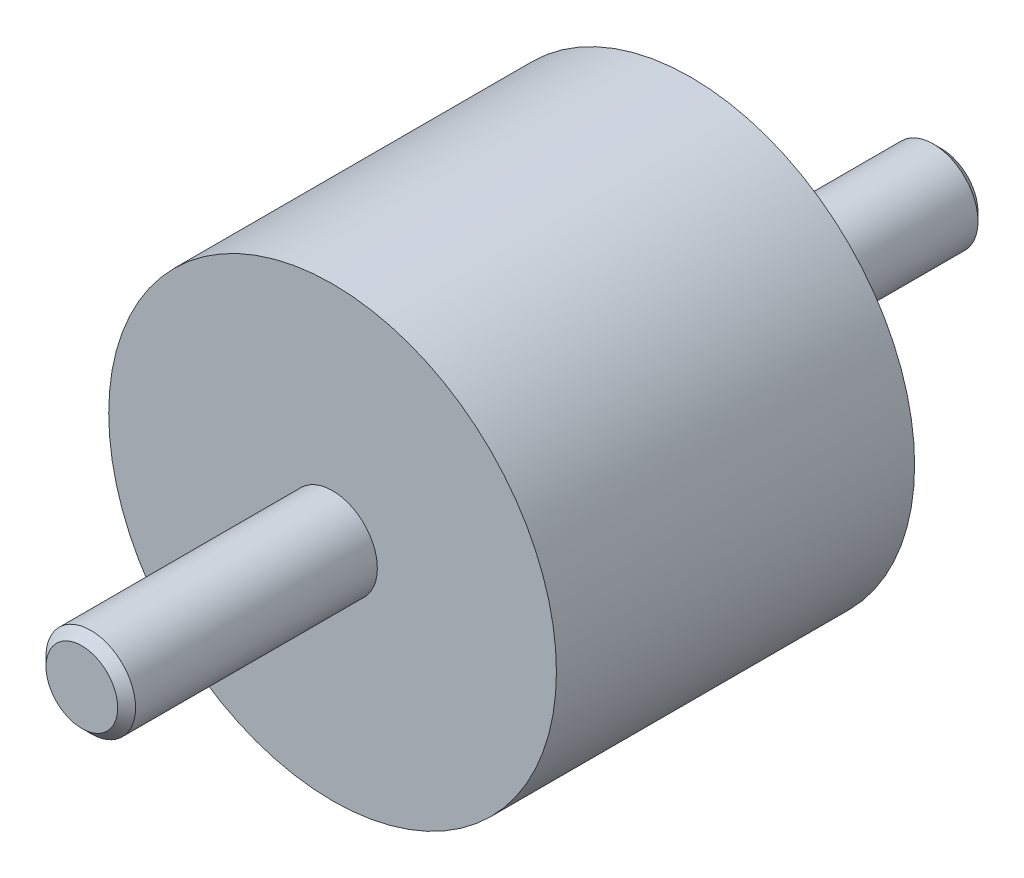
ISO-10303-21;
HEADER;
FILE_DESCRIPTION(('STEP AP214'),'2;1');
FILE_NAME('part.step','',(''),(''),'','','');
FILE_SCHEMA(('AUTOMOTIVE_DESIGN { 1 0 10303 214 1 1 1 1 }'));
ENDSEC;
DATA;
#1=APPLICATION_CONTEXT('core data for automotive mechanical design processes');
#2=APPLICATION_PROTOCOL_DEFINITION('international standard','automotive_design',2000,#1);
#3=PRODUCT_CONTEXT('',#1,'mechanical');
#4=PRODUCT('Part','Part','',(#3));
#5=PRODUCT_RELATED_PRODUCT_CATEGORY('part','',(#4));
#6=PRODUCT_DEFINITION_FORMATION('','',#4);
#7=PRODUCT_DEFINITION_CONTEXT('part definition',#1,'design');
#8=PRODUCT_DEFINITION('design','',#6,#7);
#9=PRODUCT_DEFINITION_SHAPE('','',#8);
#10=(LENGTH_UNIT() NAMED_UNIT(*) SI_UNIT(.MILLI.,.METRE.));
#11=(NAMED_UNIT(*) PLANE_ANGLE_UNIT() SI_UNIT($,.RADIAN.));
#12=(NAMED_UNIT(*) SI_UNIT($,.STERADIAN.) SOLID_ANGLE_UNIT());
#13=UNCERTAINTY_MEASURE_WITH_UNIT(LENGTH_MEASURE(1.E-05),#10,'distance_accuracy_value','');
#14=(GEOMETRIC_REPRESENTATION_CONTEXT(3) GLOBAL_UNCERTAINTY_ASSIGNED_CONTEXT((#13)) GLOBAL_UNIT_ASSIGNED_CONTEXT((#10,
#11,#12)) REPRESENTATION_CONTEXT('',''));
#15=CARTESIAN_POINT('',(0.,0.,0.));
#16=DIRECTION('',(0.,0.,1.));
#17=DIRECTION('',(1.,0.,0.));
#18=AXIS2_PLACEMENT_3D('',#15,#16,#17);
#19=CARTESIAN_POINT('',(0.,0.,0.66666666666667));
#20=DIRECTION('',(0.,0.,1.));
#21=DIRECTION('',(0.,-1.,0.));
#22=AXIS2_PLACEMENT_3D('',#19,#20,#21);
#23=CYLINDRICAL_SURFACE('',#22,25.);
#24=CARTESIAN_POINT('',(0.,0.,0.));
#25=DIRECTION('',(0.,0.,1.));
#26=DIRECTION('',(0.,-1.,0.));
#27=AXIS2_PLACEMENT_3D('',#24,#25,#26);
#28=CIRCLE('',#27,25.);
#29=CARTESIAN_POINT('',(0.,-25.,0.));
#30=VERTEX_POINT('',#29);
#31=EDGE_CURVE('E22',#30,#30,#28,.T.);
#32=ORIENTED_EDGE('',*,*,#31,.T.);
#33=EDGE_LOOP('',(#32));
#34=FACE_BOUND('',#33,.T.);
#35=CARTESIAN_POINT('',(0.,0.,40.));
#36=DIRECTION('',(0.,0.,-1.));
#37=DIRECTION('',(-1.,0.,0.));
#38=AXIS2_PLACEMENT_3D('',#35,#36,#37);
#39=CIRCLE('',#38,25.);
#40=CARTESIAN_POINT('',(-25.,0.,40.));
#41=VERTEX_POINT('',#40);
#42=EDGE_CURVE('E34',#41,#41,#39,.T.);
#43=ORIENTED_EDGE('',*,*,#42,.T.);
#44=EDGE_LOOP('',(#43));
#45=FACE_BOUND('',#44,.T.);
#46=ADVANCED_FACE('F12',(#34,#45),#23,.T.);
#47=CARTESIAN_POINT('',(25.,0.,0.));
#48=DIRECTION('',(0.,0.,-1.));
#49=DIRECTION('',(0.,1.,0.));
#50=AXIS2_PLACEMENT_3D('',#47,#48,#49);
#51=PLANE('',#50);
#52=CARTESIAN_POINT('',(0.,0.,0.));
#53=DIRECTION('',(0.,0.,-1.));
#54=DIRECTION('',(0.,1.,0.));
#55=AXIS2_PLACEMENT_3D('',#52,#53,#54);
#56=CIRCLE('',#55,5.);
#57=CARTESIAN_POINT('',(0.,5.,0.));
#58=VERTEX_POINT('',#57);
#59=EDGE_CURVE('E18',#58,#58,#56,.T.);
#60=ORIENTED_EDGE('',*,*,#59,.F.);
#61=EDGE_LOOP('',(#60));
#62=FACE_BOUND('',#61,.T.);
#63=ORIENTED_EDGE('',*,*,#31,.F.);
#64=EDGE_LOOP('',(#63));
#65=FACE_BOUND('',#64,.T.);
#66=ADVANCED_FACE('F57',(#62,#65),#51,.T.);
#67=CARTESIAN_POINT('',(0.,0.,-28.));
#68=DIRECTION('',(0.,0.,1.));
#69=DIRECTION('',(0.,-1.,0.));
#70=AXIS2_PLACEMENT_3D('',#67,#68,#69);
#71=CYLINDRICAL_SURFACE('',#70,5.);
#72=CARTESIAN_POINT('',(0.,0.,-27.08));
#73=DIRECTION('',(0.,0.,1.));
#74=DIRECTION('',(0.,-1.,0.));
#75=AXIS2_PLACEMENT_3D('',#72,#73,#74);
#76=CIRCLE('',#75,5.);
#77=CARTESIAN_POINT('',(0.,-5.,-27.08));
#78=VERTEX_POINT('',#77);
#79=EDGE_CURVE('E26',#78,#78,#76,.T.);
#80=ORIENTED_EDGE('',*,*,#79,.T.);
#81=EDGE_LOOP('',(#80));
#82=FACE_BOUND('',#81,.T.);
#83=ORIENTED_EDGE('',*,*,#59,.T.);
#84=EDGE_LOOP('',(#83));
#85=FACE_BOUND('',#84,.T.);
#86=ADVANCED_FACE('F62',(#82,#85),#71,.T.);
#87=CARTESIAN_POINT('',(0.,0.,-27.08));
#88=DIRECTION('',(0.,0.,1.));
#89=DIRECTION('',(0.,-1.,0.));
#90=AXIS2_PLACEMENT_3D('',#87,#88,#89);
#91=CONICAL_SURFACE('',#90,5.,0.785398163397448);
#92=CARTESIAN_POINT('',(0.,0.,-28.));
#93=DIRECTION('',(0.,0.,1.));
#94=DIRECTION('',(0.,-1.,0.));
#95=AXIS2_PLACEMENT_3D('',#92,#93,#94);
#96=CIRCLE('',#95,4.08);
#97=CARTESIAN_POINT('',(0.,-4.08,-28.));
#98=VERTEX_POINT('',#97);
#99=EDGE_CURVE('E31',#98,#98,#96,.T.);
#100=ORIENTED_EDGE('',*,*,#99,.T.);
#101=EDGE_LOOP('',(#100));
#102=FACE_BOUND('',#101,.T.);
#103=ORIENTED_EDGE('',*,*,#79,.F.);
#104=EDGE_LOOP('',(#103));
#105=FACE_BOUND('',#104,.T.);
#106=ADVANCED_FACE('F78',(#102,#105),#91,.T.);
#107=CARTESIAN_POINT('',(4.08,0.,-28.));
#108=DIRECTION('',(0.,0.,-1.));
#109=DIRECTION('',(0.,1.,0.));
#110=AXIS2_PLACEMENT_3D('',#107,#108,#109);
#111=PLANE('',#110);
#112=ORIENTED_EDGE('',*,*,#99,.F.);
#113=EDGE_LOOP('',(#112));
#114=FACE_BOUND('',#113,.T.);
#115=ADVANCED_FACE('F70',(#114),#111,.T.);
#116=CARTESIAN_POINT('',(0.,25.,40.));
#117=DIRECTION('',(0.,0.,1.));
#118=DIRECTION('',(1.,0.,0.));
#119=AXIS2_PLACEMENT_3D('',#116,#117,#118);
#120=PLANE('',#119);
#121=CARTESIAN_POINT('',(0.,0.,40.));
#122=DIRECTION('',(0.,0.,1.));
#123=DIRECTION('',(1.,0.,0.));
#124=AXIS2_PLACEMENT_3D('',#121,#122,#123);
#125=CIRCLE('',#124,5.);
#126=CARTESIAN_POINT('',(5.,0.,40.));
#127=VERTEX_POINT('',#126);
#128=EDGE_CURVE('E8',#127,#127,#125,.F.);
#129=ORIENTED_EDGE('',*,*,#128,.T.);
#130=EDGE_LOOP('',(#129));
#131=FACE_BOUND('',#130,.T.);
#132=ORIENTED_EDGE('',*,*,#42,.F.);
#133=EDGE_LOOP('',(#132));
#134=FACE_BOUND('',#133,.T.);
#135=ADVANCED_FACE('F68',(#131,#134),#120,.T.);
#136=CARTESIAN_POINT('',(0.,0.,20.));
#137=DIRECTION('',(0.,0.,1.));
#138=DIRECTION('',(0.,-1.,0.));
#139=AXIS2_PLACEMENT_3D('',#136,#137,#138);
#140=CYLINDRICAL_SURFACE('',#139,5.);
#141=ORIENTED_EDGE('',*,*,#128,.F.);
#142=EDGE_LOOP('',(#141));
#143=FACE_BOUND('',#142,.T.);
#144=CARTESIAN_POINT('',(0.,0.,67.0023270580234));
#145=DIRECTION('',(0.,0.,-1.));
#146=DIRECTION('',(-1.,0.,0.));
#147=AXIS2_PLACEMENT_3D('',#144,#145,#146);
#148=CIRCLE('',#147,5.);
#149=CARTESIAN_POINT('',(-5.,0.,67.0023270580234));
#150=VERTEX_POINT('',#149);
#151=EDGE_CURVE('E37',#150,#150,#148,.T.);
#152=ORIENTED_EDGE('',*,*,#151,.T.);
#153=EDGE_LOOP('',(#152));
#154=FACE_BOUND('',#153,.T.);
#155=ADVANCED_FACE('F54',(#143,#154),#140,.T.);
#156=CARTESIAN_POINT('',(0.,0.,67.0023270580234));
#157=DIRECTION('',(0.,0.,-1.));
#158=DIRECTION('',(-1.,0.,0.));
#159=AXIS2_PLACEMENT_3D('',#156,#157,#158);
#160=CONICAL_SURFACE('',#159,5.,0.785398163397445);
#161=CARTESIAN_POINT('',(0.,0.,68.));
#162=DIRECTION('',(0.,0.,-1.));
#163=DIRECTION('',(-1.,0.,0.));
#164=AXIS2_PLACEMENT_3D('',#161,#162,#163);
#165=CIRCLE('',#164,4.00232705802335);
#166=CARTESIAN_POINT('',(-4.00232705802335,0.,68.));
#167=VERTEX_POINT('',#166);
#168=EDGE_CURVE('E40',#167,#167,#165,.T.);
#169=ORIENTED_EDGE('',*,*,#168,.T.);
#170=EDGE_LOOP('',(#169));
#171=FACE_BOUND('',#170,.T.);
#172=ORIENTED_EDGE('',*,*,#151,.F.);
#173=EDGE_LOOP('',(#172));
#174=FACE_BOUND('',#173,.T.);
#175=ADVANCED_FACE('F44',(#171,#174),#160,.T.);
#176=CARTESIAN_POINT('',(0.,4.00232705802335,68.));
#177=DIRECTION('',(0.,0.,1.));
#178=DIRECTION('',(1.,0.,0.));
#179=AXIS2_PLACEMENT_3D('',#176,#177,#178);
#180=PLANE('',#179);
#181=ORIENTED_EDGE('',*,*,#168,.F.);
#182=EDGE_LOOP('',(#181));
#183=FACE_BOUND('',#182,.T.);
#184=ADVANCED_FACE('F47',(#183),#180,.T.);
#185=CLOSED_SHELL('',(#46,#66,#86,#106,#115,#135,#155,#175,#184));
#186=MANIFOLD_SOLID_BREP('B1',#185);
#187=ADVANCED_BREP_SHAPE_REPRESENTATION('',(#18,#186),#14);
#188=SHAPE_DEFINITION_REPRESENTATION(#9,#187);
ENDSEC;
END-ISO-10303-21;
